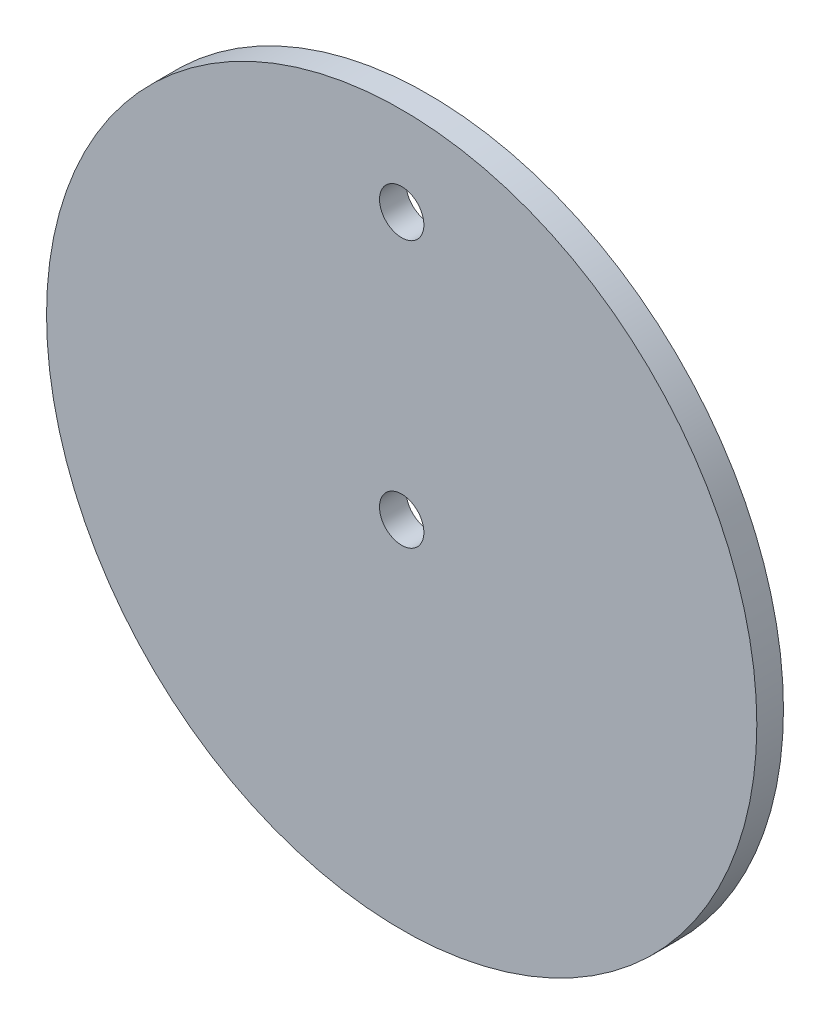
from build123d import *

# Parameters (mm, degrees)
ESQUISSE1_R      = 40
ESQUISSE1_R_2    = 2.5
EXTRUSION1_DEPTH = 3


with BuildPart() as part:
    # Esquisse1 → Extrusion1 (new body)
    with BuildSketch(Plane.XY):
        Circle(ESQUISSE1_R)
        Circle(ESQUISSE1_R_2, mode=Mode.SUBTRACT)
        with Locations((0, 30)):
            Circle(ESQUISSE1_R_2, mode=Mode.SUBTRACT)
    extrude(amount=EXTRUSION1_DEPTH)


solid = part.part
